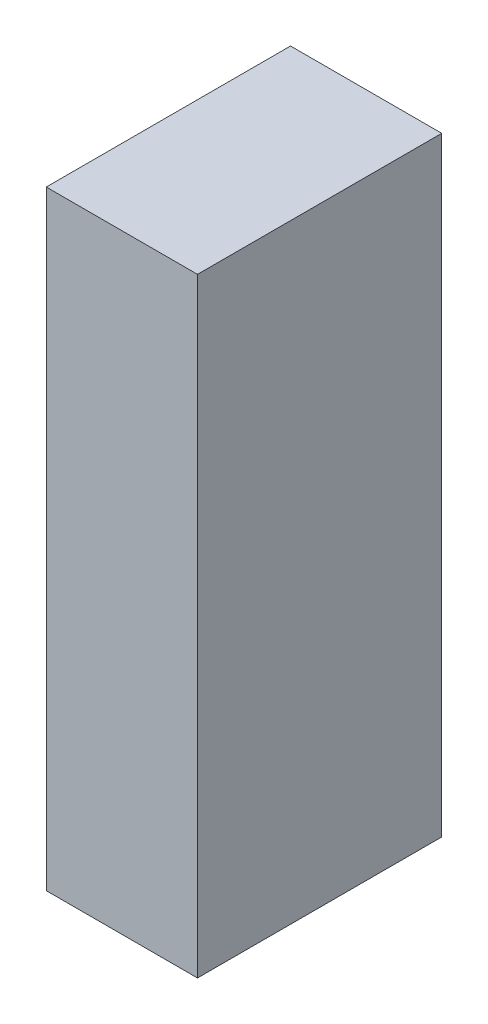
ISO-10303-21;
HEADER;
FILE_DESCRIPTION(('STEP AP214'),'2;1');
FILE_NAME('part.step','',(''),(''),'','','');
FILE_SCHEMA(('AUTOMOTIVE_DESIGN { 1 0 10303 214 1 1 1 1 }'));
ENDSEC;
DATA;
#1=APPLICATION_CONTEXT('core data for automotive mechanical design processes');
#2=APPLICATION_PROTOCOL_DEFINITION('international standard','automotive_design',2000,#1);
#3=PRODUCT_CONTEXT('',#1,'mechanical');
#4=PRODUCT('Part','Part','',(#3));
#5=PRODUCT_RELATED_PRODUCT_CATEGORY('part','',(#4));
#6=PRODUCT_DEFINITION_FORMATION('','',#4);
#7=PRODUCT_DEFINITION_CONTEXT('part definition',#1,'design');
#8=PRODUCT_DEFINITION('design','',#6,#7);
#9=PRODUCT_DEFINITION_SHAPE('','',#8);
#10=(LENGTH_UNIT() NAMED_UNIT(*) SI_UNIT(.MILLI.,.METRE.));
#11=(NAMED_UNIT(*) PLANE_ANGLE_UNIT() SI_UNIT($,.RADIAN.));
#12=(NAMED_UNIT(*) SI_UNIT($,.STERADIAN.) SOLID_ANGLE_UNIT());
#13=UNCERTAINTY_MEASURE_WITH_UNIT(LENGTH_MEASURE(1.E-05),#10,'distance_accuracy_value','');
#14=(GEOMETRIC_REPRESENTATION_CONTEXT(3) GLOBAL_UNCERTAINTY_ASSIGNED_CONTEXT((#13)) GLOBAL_UNIT_ASSIGNED_CONTEXT((#10,
#11,#12)) REPRESENTATION_CONTEXT('',''));
#15=CARTESIAN_POINT('',(0.,0.,0.));
#16=DIRECTION('',(0.,0.,1.));
#17=DIRECTION('',(1.,0.,0.));
#18=AXIS2_PLACEMENT_3D('',#15,#16,#17);
#19=CARTESIAN_POINT('',(-44.9796374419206,-25.5756492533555,24.1141899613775));
#20=DIRECTION('',(0.,1.,0.));
#21=DIRECTION('',(0.,0.,1.));
#22=AXIS2_PLACEMENT_3D('',#19,#20,#21);
#23=PLANE('',#22);
#24=DIRECTION('',(1.,0.,0.));
#25=VECTOR('',#24,1.);
#26=CARTESIAN_POINT('',(-44.9796374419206,-25.5756492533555,24.1141899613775));
#27=LINE('',#26,#25);
#28=CARTESIAN_POINT('',(35.0203625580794,-25.5756492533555,24.1141899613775));
#29=VERTEX_POINT('',#28);
#30=CARTESIAN_POINT('',(52.1087575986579,-25.5756492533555,24.1141899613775));
#31=VERTEX_POINT('',#30);
#32=EDGE_CURVE('E86',#29,#31,#27,.T.);
#33=ORIENTED_EDGE('',*,*,#32,.F.);
#34=DIRECTION('',(0.,0.,-1.));
#35=VECTOR('',#34,1.);
#36=CARTESIAN_POINT('',(35.0203625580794,-25.5756492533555,24.1141899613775));
#37=LINE('',#36,#35);
#38=CARTESIAN_POINT('',(35.0203625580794,-25.5756492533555,-3.48581003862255));
#39=VERTEX_POINT('',#38);
#40=EDGE_CURVE('E91',#29,#39,#37,.T.);
#41=ORIENTED_EDGE('',*,*,#40,.T.);
#42=DIRECTION('',(1.,0.,0.));
#43=VECTOR('',#42,1.);
#44=CARTESIAN_POINT('',(-44.9796374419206,-25.5756492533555,-3.48581003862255));
#45=LINE('',#44,#43);
#46=CARTESIAN_POINT('',(52.1087575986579,-25.5756492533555,-3.48581003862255));
#47=VERTEX_POINT('',#46);
#48=EDGE_CURVE('E78',#39,#47,#45,.T.);
#49=ORIENTED_EDGE('',*,*,#48,.T.);
#50=DIRECTION('',(0.,0.,-1.));
#51=VECTOR('',#50,1.);
#52=CARTESIAN_POINT('',(52.1087575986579,-25.5756492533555,24.1141899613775));
#53=LINE('',#52,#51);
#54=EDGE_CURVE('E11',#31,#47,#53,.T.);
#55=ORIENTED_EDGE('',*,*,#54,.F.);
#56=EDGE_LOOP('',(#33,#41,#49,#55));
#57=FACE_BOUND('',#56,.T.);
#58=ADVANCED_FACE('F34',(#57),#23,.F.);
#59=CARTESIAN_POINT('',(-44.9796374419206,43.2836830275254,24.1141899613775));
#60=DIRECTION('',(0.,-1.,0.));
#61=DIRECTION('',(0.,0.,-1.));
#62=AXIS2_PLACEMENT_3D('',#59,#60,#61);
#63=PLANE('',#62);
#64=DIRECTION('',(-1.,0.,0.));
#65=VECTOR('',#64,1.);
#66=CARTESIAN_POINT('',(-44.9796374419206,43.2836830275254,-3.48581003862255));
#67=LINE('',#66,#65);
#68=CARTESIAN_POINT('',(52.1087575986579,43.2836830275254,-3.48581003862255));
#69=VERTEX_POINT('',#68);
#70=CARTESIAN_POINT('',(35.0203625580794,43.2836830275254,-3.48581003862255));
#71=VERTEX_POINT('',#70);
#72=EDGE_CURVE('E77',#69,#71,#67,.T.);
#73=ORIENTED_EDGE('',*,*,#72,.T.);
#74=DIRECTION('',(0.,0.,-1.));
#75=VECTOR('',#74,1.);
#76=CARTESIAN_POINT('',(35.0203625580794,43.2836830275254,24.1141899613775));
#77=LINE('',#76,#75);
#78=CARTESIAN_POINT('',(35.0203625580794,43.2836830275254,24.1141899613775));
#79=VERTEX_POINT('',#78);
#80=EDGE_CURVE('E48',#79,#71,#77,.T.);
#81=ORIENTED_EDGE('',*,*,#80,.F.);
#82=DIRECTION('',(-1.,0.,0.));
#83=VECTOR('',#82,1.);
#84=CARTESIAN_POINT('',(-44.9796374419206,43.2836830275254,24.1141899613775));
#85=LINE('',#84,#83);
#86=CARTESIAN_POINT('',(52.1087575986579,43.2836830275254,24.1141899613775));
#87=VERTEX_POINT('',#86);
#88=EDGE_CURVE('E83',#87,#79,#85,.T.);
#89=ORIENTED_EDGE('',*,*,#88,.F.);
#90=DIRECTION('',(0.,0.,-1.));
#91=VECTOR('',#90,1.);
#92=CARTESIAN_POINT('',(52.1087575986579,43.2836830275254,24.1141899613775));
#93=LINE('',#92,#91);
#94=EDGE_CURVE('E41',#87,#69,#93,.T.);
#95=ORIENTED_EDGE('',*,*,#94,.T.);
#96=EDGE_LOOP('',(#73,#81,#89,#95));
#97=FACE_BOUND('',#96,.T.);
#98=ADVANCED_FACE('F82',(#97),#63,.F.);
#99=CARTESIAN_POINT('',(-44.9796374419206,-25.5756492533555,24.1141899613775));
#100=DIRECTION('',(0.,0.,1.));
#101=DIRECTION('',(1.,0.,0.));
#102=AXIS2_PLACEMENT_3D('',#99,#100,#101);
#103=PLANE('',#102);
#104=DIRECTION('',(0.,-1.,0.));
#105=VECTOR('',#104,1.);
#106=CARTESIAN_POINT('',(35.0203625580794,43.2836830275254,24.1141899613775));
#107=LINE('',#106,#105);
#108=EDGE_CURVE('E97',#79,#29,#107,.T.);
#109=ORIENTED_EDGE('',*,*,#108,.T.);
#110=ORIENTED_EDGE('',*,*,#32,.T.);
#111=DIRECTION('',(0.,1.,0.));
#112=VECTOR('',#111,1.);
#113=CARTESIAN_POINT('',(52.1087575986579,43.2836830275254,24.1141899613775));
#114=LINE('',#113,#112);
#115=EDGE_CURVE('E57',#31,#87,#114,.T.);
#116=ORIENTED_EDGE('',*,*,#115,.T.);
#117=ORIENTED_EDGE('',*,*,#88,.T.);
#118=EDGE_LOOP('',(#109,#110,#116,#117));
#119=FACE_BOUND('',#118,.T.);
#120=ADVANCED_FACE('F102',(#119),#103,.T.);
#121=CARTESIAN_POINT('',(-44.9796374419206,-25.5756492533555,-3.48581003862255));
#122=DIRECTION('',(0.,0.,1.));
#123=DIRECTION('',(1.,0.,0.));
#124=AXIS2_PLACEMENT_3D('',#121,#122,#123);
#125=PLANE('',#124);
#126=ORIENTED_EDGE('',*,*,#48,.F.);
#127=DIRECTION('',(0.,-1.,0.));
#128=VECTOR('',#127,1.);
#129=CARTESIAN_POINT('',(35.0203625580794,43.2836830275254,-3.48581003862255));
#130=LINE('',#129,#128);
#131=EDGE_CURVE('E85',#71,#39,#130,.T.);
#132=ORIENTED_EDGE('',*,*,#131,.F.);
#133=ORIENTED_EDGE('',*,*,#72,.F.);
#134=DIRECTION('',(0.,1.,0.));
#135=VECTOR('',#134,1.);
#136=CARTESIAN_POINT('',(52.1087575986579,43.2836830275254,-3.48581003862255));
#137=LINE('',#136,#135);
#138=EDGE_CURVE('E69',#47,#69,#137,.T.);
#139=ORIENTED_EDGE('',*,*,#138,.F.);
#140=EDGE_LOOP('',(#126,#132,#133,#139));
#141=FACE_BOUND('',#140,.T.);
#142=ADVANCED_FACE('F84',(#141),#125,.F.);
#143=CARTESIAN_POINT('',(52.1087575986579,43.2836830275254,24.1141899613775));
#144=DIRECTION('',(-1.,0.,0.));
#145=DIRECTION('',(0.,0.,1.));
#146=AXIS2_PLACEMENT_3D('',#143,#144,#145);
#147=PLANE('',#146);
#148=ORIENTED_EDGE('',*,*,#138,.T.);
#149=ORIENTED_EDGE('',*,*,#94,.F.);
#150=ORIENTED_EDGE('',*,*,#115,.F.);
#151=ORIENTED_EDGE('',*,*,#54,.T.);
#152=EDGE_LOOP('',(#148,#149,#150,#151));
#153=FACE_BOUND('',#152,.T.);
#154=ADVANCED_FACE('F71',(#153),#147,.F.);
#155=CARTESIAN_POINT('',(35.0203625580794,43.2836830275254,24.1141899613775));
#156=DIRECTION('',(1.,0.,0.));
#157=DIRECTION('',(0.,0.,-1.));
#158=AXIS2_PLACEMENT_3D('',#155,#156,#157);
#159=PLANE('',#158);
#160=ORIENTED_EDGE('',*,*,#131,.T.);
#161=ORIENTED_EDGE('',*,*,#40,.F.);
#162=ORIENTED_EDGE('',*,*,#108,.F.);
#163=ORIENTED_EDGE('',*,*,#80,.T.);
#164=EDGE_LOOP('',(#160,#161,#162,#163));
#165=FACE_BOUND('',#164,.T.);
#166=ADVANCED_FACE('F108',(#165),#159,.F.);
#167=CLOSED_SHELL('',(#58,#98,#120,#142,#154,#166));
#168=MANIFOLD_SOLID_BREP('B2',#167);
#169=ADVANCED_BREP_SHAPE_REPRESENTATION('',(#18,#168),#14);
#170=SHAPE_DEFINITION_REPRESENTATION(#9,#169);
ENDSEC;
END-ISO-10303-21;
